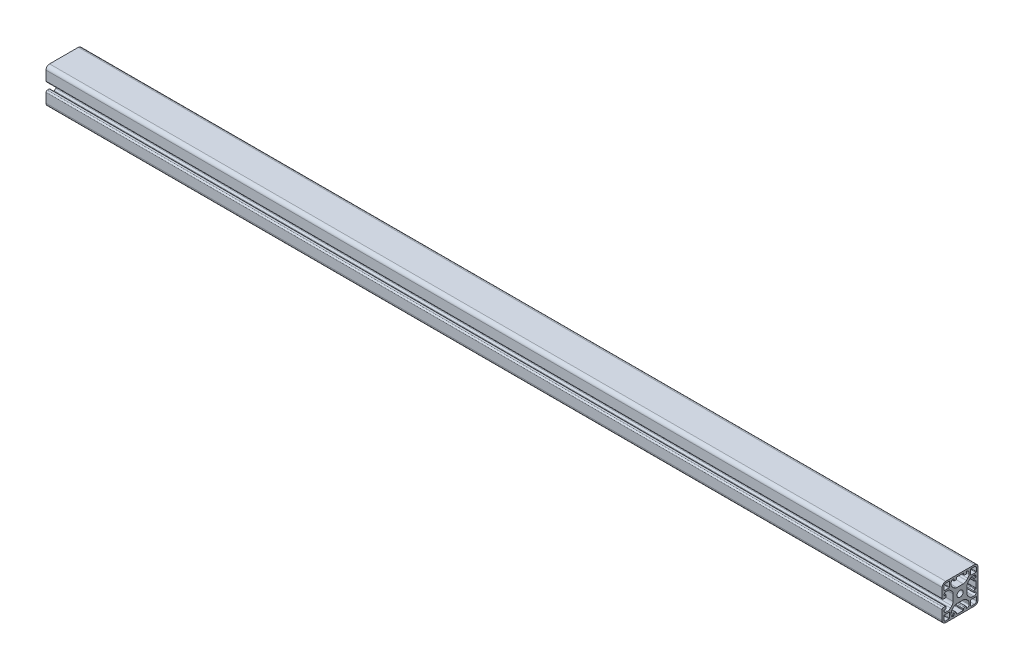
from build123d import *

# Parameters (mm, degrees)
MODEL1_R               = 3.4
STRUKTURBAUTEIL1_DEPTH = 1000


with BuildPart() as part:
    # Model1 → Strukturbauteil1 (new body)
    with BuildSketch(Plane.YZ):
        with BuildLine():
            Line((-20.000000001, 16.000000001), (-20.000000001, -16.000000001))
            ThreePointArc((-20.000000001, -16.000000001), (-18.828427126, -18.828427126), (-16.000000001, -20.000000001))
            Line((-16.000000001, -20.000000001), (16.000000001, -20.000000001))
            ThreePointArc((16.000000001, -20.000000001), (18.828427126, -18.828427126), (20.000000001, -16.000000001))
            Line((20.000000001, -16.000000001), (20.000000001, 16.000000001))
            ThreePointArc((20.000000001, 16.000000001), (18.828427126, 18.828427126), (16.000000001, 20.000000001))
            Line((16.000000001, 20.000000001), (5.5, 20.000000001))
            ThreePointArc((5.5, 20.000000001), (4.439339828, 19.560660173), (4, 18.500000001))
            Line((4, 18.500000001), (4, 16.500000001))
            ThreePointArc((4, 16.500000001), (4.292893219, 15.792893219), (5, 15.500000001))
            Line((5, 15.500000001), (6.5, 15.500000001))
            ThreePointArc((6.5, 15.500000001), (6.853553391, 15.64644661), (7, 16.000000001))
            Line((7, 16.000000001), (7, 17.500000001))
            ThreePointArc((7, 17.500000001), (7.14644661, 17.853553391), (7.5, 18.000000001))
            ThreePointArc((7.5, 18.000000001), (9.267766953, 17.267766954), (10, 15.500000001))
            Line((10, 15.500000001), (10, 14.19098772))
            ThreePointArc((10, 14.19098772), (9.619397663, 12.277570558), (8.535533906, 10.655453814))
            Line((8.535533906, 10.655453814), (7.094546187, 9.214466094))
            ThreePointArc((7.094546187, 9.214466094), (5.472429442, 8.130602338), (3.559012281, 7.75))
            Line((3.559012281, 7.75), (-3.55883888, 7.75))
            ThreePointArc((-3.55883888, 7.75), (-5.472266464, 8.130606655), (-7.094388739, 9.214482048))
            Line((-7.094388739, 9.214482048), (-8.53554986, 10.655656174))
            ThreePointArc((-8.53554986, 10.655656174), (-9.61940198, 12.277767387), (-10, 14.191174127))
            Line((-10, 14.191174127), (-10, 15.500000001))
            ThreePointArc((-10, 15.500000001), (-9.267766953, 17.267766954), (-7.5, 18.000000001))
            ThreePointArc((-7.5, 18.000000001), (-7.14644661, 17.853553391), (-7, 17.500000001))
            Line((-7, 17.500000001), (-7, 16.000000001))
            ThreePointArc((-7, 16.000000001), (-6.853553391, 15.64644661), (-6.5, 15.500000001))
            Line((-6.5, 15.500000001), (-5, 15.500000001))
            ThreePointArc((-5, 15.500000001), (-4.292893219, 15.792893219), (-4, 16.500000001))
            Line((-4, 16.500000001), (-4, 18.500000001))
            ThreePointArc((-4, 18.500000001), (-4.439339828, 19.560660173), (-5.5, 20.000000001))
            Line((-5.5, 20.000000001), (-16.000000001, 20.000000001))
            ThreePointArc((-16.000000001, 20.000000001), (-18.828427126, 18.828427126), (-20.000000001, 16.000000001))
        make_face()
        Circle(MODEL1_R, mode=Mode.SUBTRACT)
        with BuildLine():
            Line((-18.200000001, 16.000000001), (-18.200000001, 12.300000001))
            ThreePointArc((-18.200000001, 12.300000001), (-18.053553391, 11.94644661), (-17.700000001, 11.8))
            Line((-17.700000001, 11.8), (-12.300000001, 11.8))
            ThreePointArc((-12.300000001, 11.8), (-11.94644661, 11.94644661), (-11.8, 12.300000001))
            Line((-11.8, 12.300000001), (-11.8, 17.700000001))
            ThreePointArc((-11.8, 17.700000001), (-11.94644661, 18.053553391), (-12.300000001, 18.200000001))
            Line((-12.300000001, 18.200000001), (-16.000000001, 18.200000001))
            ThreePointArc((-16.000000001, 18.200000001), (-17.555634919, 17.555634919), (-18.200000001, 16.000000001))
        make_face(mode=Mode.SUBTRACT)
        with BuildLine():
            Line((-18.200000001, -12.300000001), (-18.200000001, -16.000000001))
            ThreePointArc((-18.200000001, -16.000000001), (-17.555634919, -17.555634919), (-16.000000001, -18.200000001))
            Line((-16.000000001, -18.200000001), (-12.300000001, -18.200000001))
            ThreePointArc((-12.300000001, -18.200000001), (-11.94644661, -18.053553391), (-11.8, -17.700000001))
            Line((-11.8, -17.700000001), (-11.8, -12.300000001))
            ThreePointArc((-11.8, -12.300000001), (-11.94644661, -11.94644661), (-12.300000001, -11.8))
            Line((-12.300000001, -11.8), (-17.700000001, -11.8))
            ThreePointArc((-17.700000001, -11.8), (-18.053553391, -11.94644661), (-18.200000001, -12.300000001))
        make_face(mode=Mode.SUBTRACT)
        with BuildLine():
            Line((-17.999939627, 3.499939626), (-17.999939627, -3.499939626))
            ThreePointArc((-17.999939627, -3.499939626), (-17.853493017, -3.853493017), (-17.499939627, -3.999939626))
            Line((-17.499939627, -3.999939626), (-16.499939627, -3.999939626))
            ThreePointArc((-16.499939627, -3.999939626), (-15.792832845, -4.292832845), (-15.499939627, -4.999939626))
            Line((-15.499939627, -4.999939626), (-15.499939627, -6.499939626))
            ThreePointArc((-15.499939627, -6.499939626), (-15.646386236, -6.853493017), (-15.999939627, -6.999939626))
            Line((-15.999939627, -6.999939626), (-17.499939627, -6.999939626))
            ThreePointArc((-17.499939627, -6.999939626), (-17.853493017, -7.146386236), (-17.999939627, -7.499939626))
            ThreePointArc((-17.999939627, -7.499939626), (-17.26770658, -9.267706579), (-15.499939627, -9.999939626))
            Line((-15.499939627, -9.999939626), (-14.190940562, -9.999939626))
            ThreePointArc((-14.190940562, -9.999939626), (-12.277512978, -9.619332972), (-10.655390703, -8.535457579))
            Line((-10.655390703, -8.535457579), (-9.214409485, -7.094463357))
            ThreePointArc((-9.214409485, -7.094463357), (-8.130557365, -5.472352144), (-7.749959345, -3.558945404))
            Line((-7.749959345, -3.558945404), (-7.749959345, 3.558971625))
            ThreePointArc((-7.749959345, 3.558971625), (-8.130561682, 5.472388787), (-9.214425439, 7.094505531))
            Line((-9.214425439, 7.094505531), (-10.65539344, 8.535473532))
            ThreePointArc((-10.65539344, 8.535473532), (-12.277510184, 9.619337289), (-14.190927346, 9.999939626))
            Line((-14.190927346, 9.999939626), (-15.499939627, 9.999939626))
            ThreePointArc((-15.499939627, 9.999939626), (-17.26770658, 9.267706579), (-17.999939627, 7.499939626))
            ThreePointArc((-17.999939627, 7.499939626), (-17.853493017, 7.146386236), (-17.499939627, 6.999939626))
            Line((-17.499939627, 6.999939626), (-15.999939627, 6.999939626))
            ThreePointArc((-15.999939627, 6.999939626), (-15.646386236, 6.853493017), (-15.499939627, 6.499939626))
            Line((-15.499939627, 6.499939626), (-15.499939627, 4.999939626))
            ThreePointArc((-15.499939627, 4.999939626), (-15.792832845, 4.292832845), (-16.499939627, 3.999939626))
            Line((-16.499939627, 3.999939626), (-17.499939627, 3.999939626))
            ThreePointArc((-17.499939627, 3.999939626), (-17.853493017, 3.853493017), (-17.999939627, 3.499939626))
        make_face(mode=Mode.SUBTRACT)
        with BuildLine():
            Line((12.300000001, -18.200000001), (16.000000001, -18.200000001))
            ThreePointArc((16.000000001, -18.200000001), (17.555634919, -17.555634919), (18.200000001, -16.000000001))
            Line((18.200000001, -16.000000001), (18.200000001, -12.300000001))
            ThreePointArc((18.200000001, -12.300000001), (18.053553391, -11.94644661), (17.700000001, -11.8))
            Line((17.700000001, -11.8), (12.300000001, -11.8))
            ThreePointArc((12.300000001, -11.8), (11.94644661, -11.94644661), (11.8, -12.300000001))
            Line((11.8, -12.300000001), (11.8, -17.700000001))
            ThreePointArc((11.8, -17.700000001), (11.94644661, -18.053553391), (12.300000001, -18.200000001))
        make_face(mode=Mode.SUBTRACT)
        with BuildLine():
            Line((-3.5, -18.000000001), (3.5, -18.000000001))
            ThreePointArc((3.5, -18.000000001), (3.853553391, -17.853553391), (4, -17.500000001))
            Line((4, -17.500000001), (4, -16.500000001))
            ThreePointArc((4, -16.500000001), (4.292893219, -15.792893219), (5, -15.500000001))
            Line((5, -15.500000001), (6.5, -15.500000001))
            ThreePointArc((6.5, -15.500000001), (6.853553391, -15.64644661), (7, -16.000000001))
            Line((7, -16.000000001), (7, -17.500000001))
            ThreePointArc((7, -17.500000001), (7.14644661, -17.853553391), (7.5, -18.000000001))
            ThreePointArc((7.5, -18.000000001), (9.267766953, -17.267766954), (10, -15.500000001))
            Line((10, -15.500000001), (10, -14.19098772))
            ThreePointArc((10, -14.19098772), (9.619397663, -12.277570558), (8.535533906, -10.655453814))
            Line((8.535533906, -10.655453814), (7.094546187, -9.214466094))
            ThreePointArc((7.094546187, -9.214466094), (5.472429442, -8.130602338), (3.559012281, -7.75))
            Line((3.559012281, -7.75), (-3.55883888, -7.75))
            ThreePointArc((-3.55883888, -7.75), (-5.472266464, -8.130606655), (-7.094388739, -9.214482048))
            Line((-7.094388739, -9.214482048), (-8.53554986, -10.655656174))
            ThreePointArc((-8.53554986, -10.655656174), (-9.61940198, -12.277767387), (-10, -14.191174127))
            Line((-10, -14.191174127), (-10, -15.500000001))
            ThreePointArc((-10, -15.500000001), (-9.267766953, -17.267766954), (-7.5, -18.000000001))
            ThreePointArc((-7.5, -18.000000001), (-7.14644661, -17.853553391), (-7, -17.500000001))
            Line((-7, -17.500000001), (-7, -16.000000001))
            ThreePointArc((-7, -16.000000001), (-6.853553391, -15.64644661), (-6.5, -15.500000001))
            Line((-6.5, -15.500000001), (-5, -15.500000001))
            ThreePointArc((-5, -15.500000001), (-4.292893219, -15.792893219), (-4, -16.500000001))
            Line((-4, -16.500000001), (-4, -17.500000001))
            ThreePointArc((-4, -17.500000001), (-3.853553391, -17.853553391), (-3.5, -18.000000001))
        make_face(mode=Mode.SUBTRACT)
        with BuildLine():
            Line((14.190940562, -9.999939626), (15.499939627, -9.999939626))
            ThreePointArc((15.499939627, -9.999939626), (17.26770658, -9.267706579), (17.999939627, -7.499939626))
            ThreePointArc((17.999939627, -7.499939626), (17.853493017, -7.146386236), (17.499939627, -6.999939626))
            Line((17.499939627, -6.999939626), (15.999939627, -6.999939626))
            ThreePointArc((15.999939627, -6.999939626), (15.646386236, -6.853493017), (15.499939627, -6.499939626))
            Line((15.499939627, -6.499939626), (15.499939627, -4.999939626))
            ThreePointArc((15.499939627, -4.999939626), (15.792832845, -4.292832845), (16.499939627, -3.999939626))
            Line((16.499939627, -3.999939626), (17.499939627, -3.999939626))
            ThreePointArc((17.499939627, -3.999939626), (17.853493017, -3.853493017), (17.999939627, -3.499939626))
            Line((17.999939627, -3.499939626), (17.999939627, 3.499939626))
            ThreePointArc((17.999939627, 3.499939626), (17.853493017, 3.853493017), (17.499939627, 3.999939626))
            Line((17.499939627, 3.999939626), (16.499939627, 3.999939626))
            ThreePointArc((16.499939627, 3.999939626), (15.792832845, 4.292832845), (15.499939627, 4.999939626))
            Line((15.499939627, 4.999939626), (15.499939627, 6.499939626))
            ThreePointArc((15.499939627, 6.499939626), (15.646386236, 6.853493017), (15.999939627, 6.999939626))
            Line((15.999939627, 6.999939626), (17.499939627, 6.999939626))
            ThreePointArc((17.499939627, 6.999939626), (17.853493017, 7.146386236), (17.999939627, 7.499939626))
            ThreePointArc((17.999939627, 7.499939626), (17.26770658, 9.267706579), (15.499939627, 9.999939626))
            Line((15.499939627, 9.999939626), (14.190940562, 9.999939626))
            ThreePointArc((14.190940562, 9.999939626), (12.277512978, 9.619332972), (10.655390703, 8.535457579))
            Line((10.655390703, 8.535457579), (9.214409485, 7.094463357))
            ThreePointArc((9.214409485, 7.094463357), (8.130557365, 5.472352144), (7.749959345, 3.558945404))
            Line((7.749959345, 3.558945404), (7.749959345, -3.558945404))
            ThreePointArc((7.749959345, -3.558945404), (8.130557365, -5.472352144), (9.214409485, -7.094463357))
            Line((9.214409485, -7.094463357), (10.655390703, -8.535457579))
            ThreePointArc((10.655390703, -8.535457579), (12.277512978, -9.619332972), (14.190940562, -9.999939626))
        make_face(mode=Mode.SUBTRACT)
        with BuildLine():
            Line((11.8, 17.700000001), (11.8, 12.300000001))
            ThreePointArc((11.8, 12.300000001), (11.94644661, 11.94644661), (12.300000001, 11.8))
            Line((12.300000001, 11.8), (17.700000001, 11.8))
            ThreePointArc((17.700000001, 11.8), (18.053553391, 11.94644661), (18.200000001, 12.300000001))
            Line((18.200000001, 12.300000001), (18.200000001, 16.000000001))
            ThreePointArc((18.200000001, 16.000000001), (17.555634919, 17.555634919), (16.000000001, 18.200000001))
            Line((16.000000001, 18.200000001), (12.300000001, 18.200000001))
            ThreePointArc((12.300000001, 18.200000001), (11.94644661, 18.053553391), (11.8, 17.700000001))
        make_face(mode=Mode.SUBTRACT)
    extrude(amount=STRUKTURBAUTEIL1_DEPTH)


solid = part.part
